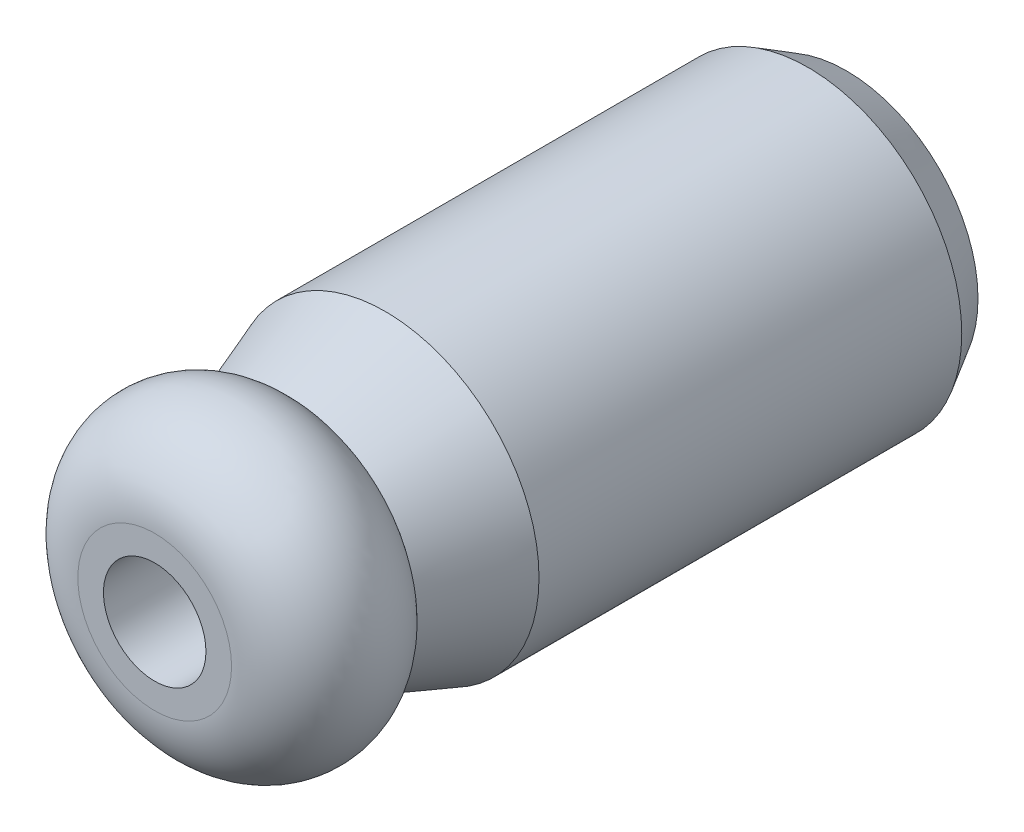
ISO-10303-21;
HEADER;
FILE_DESCRIPTION(('STEP AP214'),'2;1');
FILE_NAME('part.step','',(''),(''),'','','');
FILE_SCHEMA(('AUTOMOTIVE_DESIGN { 1 0 10303 214 1 1 1 1 }'));
ENDSEC;
DATA;
#1=APPLICATION_CONTEXT('core data for automotive mechanical design processes');
#2=APPLICATION_PROTOCOL_DEFINITION('international standard','automotive_design',2000,#1);
#3=PRODUCT_CONTEXT('',#1,'mechanical');
#4=PRODUCT('Part','Part','',(#3));
#5=PRODUCT_RELATED_PRODUCT_CATEGORY('part','',(#4));
#6=PRODUCT_DEFINITION_FORMATION('','',#4);
#7=PRODUCT_DEFINITION_CONTEXT('part definition',#1,'design');
#8=PRODUCT_DEFINITION('design','',#6,#7);
#9=PRODUCT_DEFINITION_SHAPE('','',#8);
#10=(LENGTH_UNIT() NAMED_UNIT(*) SI_UNIT(.MILLI.,.METRE.));
#11=(NAMED_UNIT(*) PLANE_ANGLE_UNIT() SI_UNIT($,.RADIAN.));
#12=(NAMED_UNIT(*) SI_UNIT($,.STERADIAN.) SOLID_ANGLE_UNIT());
#13=UNCERTAINTY_MEASURE_WITH_UNIT(LENGTH_MEASURE(1.E-05),#10,'distance_accuracy_value','');
#14=(GEOMETRIC_REPRESENTATION_CONTEXT(3) GLOBAL_UNCERTAINTY_ASSIGNED_CONTEXT((#13)) GLOBAL_UNIT_ASSIGNED_CONTEXT((#10,
#11,#12)) REPRESENTATION_CONTEXT('',''));
#15=CARTESIAN_POINT('',(0.,0.,0.));
#16=DIRECTION('',(0.,0.,1.));
#17=DIRECTION('',(1.,0.,0.));
#18=AXIS2_PLACEMENT_3D('',#15,#16,#17);
#19=CARTESIAN_POINT('',(0.,2.,19.));
#20=DIRECTION('',(0.,0.,1.));
#21=DIRECTION('',(1.,0.,0.));
#22=AXIS2_PLACEMENT_3D('',#19,#20,#21);
#23=PLANE('',#22);
#24=CARTESIAN_POINT('',(0.,0.,19.));
#25=DIRECTION('',(0.,0.,1.));
#26=DIRECTION('',(1.,0.,0.));
#27=AXIS2_PLACEMENT_3D('',#24,#25,#26);
#28=CIRCLE('',#27,2.);
#29=CARTESIAN_POINT('',(2.,0.,19.));
#30=VERTEX_POINT('',#29);
#31=EDGE_CURVE('E8',#30,#30,#28,.T.);
#32=ORIENTED_EDGE('',*,*,#31,.T.);
#33=EDGE_LOOP('',(#32));
#34=FACE_BOUND('',#33,.T.);
#35=ADVANCED_FACE('F12',(#34),#23,.T.);
#36=CARTESIAN_POINT('',(0.,0.,31.0699615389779));
#37=DIRECTION('',(0.,0.,1.));
#38=DIRECTION('',(1.,0.,0.));
#39=AXIS2_PLACEMENT_3D('',#36,#37,#38);
#40=CYLINDRICAL_SURFACE('',#39,2.);
#41=CARTESIAN_POINT('',(0.,0.,27.));
#42=DIRECTION('',(0.,0.,1.));
#43=DIRECTION('',(1.,0.,0.));
#44=AXIS2_PLACEMENT_3D('',#41,#42,#43);
#45=CIRCLE('',#44,2.);
#46=CARTESIAN_POINT('',(2.,0.,27.));
#47=VERTEX_POINT('',#46);
#48=EDGE_CURVE('E18',#47,#47,#45,.T.);
#49=ORIENTED_EDGE('',*,*,#48,.T.);
#50=EDGE_LOOP('',(#49));
#51=FACE_BOUND('',#50,.T.);
#52=ORIENTED_EDGE('',*,*,#31,.F.);
#53=EDGE_LOOP('',(#52));
#54=FACE_BOUND('',#53,.T.);
#55=ADVANCED_FACE('F54',(#51,#54),#40,.F.);
#56=CARTESIAN_POINT('',(0.,3.,27.));
#57=DIRECTION('',(0.,0.,1.));
#58=DIRECTION('',(1.,0.,0.));
#59=AXIS2_PLACEMENT_3D('',#56,#57,#58);
#60=PLANE('',#59);
#61=CARTESIAN_POINT('',(0.,0.,27.));
#62=DIRECTION('',(0.,0.,1.));
#63=DIRECTION('',(1.,0.,0.));
#64=AXIS2_PLACEMENT_3D('',#61,#62,#63);
#65=CIRCLE('',#64,3.);
#66=CARTESIAN_POINT('',(3.,0.,27.));
#67=VERTEX_POINT('',#66);
#68=EDGE_CURVE('E22',#67,#67,#65,.T.);
#69=ORIENTED_EDGE('',*,*,#68,.T.);
#70=EDGE_LOOP('',(#69));
#71=FACE_BOUND('',#70,.T.);
#72=ORIENTED_EDGE('',*,*,#48,.F.);
#73=EDGE_LOOP('',(#72));
#74=FACE_BOUND('',#73,.T.);
#75=ADVANCED_FACE('F58',(#71,#74),#60,.T.);
#76=CARTESIAN_POINT('',(0.,0.,23.9999999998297));
#77=DIRECTION('',(0.,0.,1.));
#78=DIRECTION('',(1.,0.,0.));
#79=AXIS2_PLACEMENT_3D('',#76,#77,#78);
#80=DEGENERATE_TOROIDAL_SURFACE('',#79,2.9999999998,3.00000000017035,.T.);
#81=CARTESIAN_POINT('',(0.,0.,21.53691825));
#82=DIRECTION('',(0.,0.,1.));
#83=DIRECTION('',(1.,0.,0.));
#84=AXIS2_PLACEMENT_3D('',#81,#82,#83);
#85=CIRCLE('',#84,4.712667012);
#86=CARTESIAN_POINT('',(4.712667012,0.,21.53691825));
#87=VERTEX_POINT('',#86);
#88=EDGE_CURVE('E26',#87,#87,#85,.T.);
#89=ORIENTED_EDGE('',*,*,#88,.T.);
#90=EDGE_LOOP('',(#89));
#91=FACE_BOUND('',#90,.T.);
#92=ORIENTED_EDGE('',*,*,#68,.F.);
#93=EDGE_LOOP('',(#92));
#94=FACE_BOUND('',#93,.T.);
#95=ADVANCED_FACE('F62',(#91,#94),#80,.T.);
#96=CARTESIAN_POINT('',(0.,0.,21.53691825));
#97=DIRECTION('',(0.,0.,-1.));
#98=DIRECTION('',(-1.,0.,0.));
#99=AXIS2_PLACEMENT_3D('',#96,#97,#98);
#100=CONICAL_SURFACE('',#99,4.712667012,0.349065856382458);
#101=CARTESIAN_POINT('',(0.,0.,18.));
#102=DIRECTION('',(0.,0.,1.));
#103=DIRECTION('',(1.,0.,0.));
#104=AXIS2_PLACEMENT_3D('',#101,#102,#103);
#105=CIRCLE('',#104,6.);
#106=CARTESIAN_POINT('',(6.,0.,18.));
#107=VERTEX_POINT('',#106);
#108=EDGE_CURVE('E31',#107,#107,#105,.T.);
#109=ORIENTED_EDGE('',*,*,#108,.T.);
#110=EDGE_LOOP('',(#109));
#111=FACE_BOUND('',#110,.T.);
#112=ORIENTED_EDGE('',*,*,#88,.F.);
#113=EDGE_LOOP('',(#112));
#114=FACE_BOUND('',#113,.T.);
#115=ADVANCED_FACE('F69',(#111,#114),#100,.T.);
#116=CARTESIAN_POINT('',(0.,0.,31.0699615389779));
#117=DIRECTION('',(0.,0.,1.));
#118=DIRECTION('',(1.,0.,0.));
#119=AXIS2_PLACEMENT_3D('',#116,#117,#118);
#120=CYLINDRICAL_SURFACE('',#119,6.);
#121=CARTESIAN_POINT('',(0.,0.,1.5));
#122=DIRECTION('',(0.,0.,1.));
#123=DIRECTION('',(1.,0.,0.));
#124=AXIS2_PLACEMENT_3D('',#121,#122,#123);
#125=CIRCLE('',#124,6.);
#126=CARTESIAN_POINT('',(6.,0.,1.5));
#127=VERTEX_POINT('',#126);
#128=EDGE_CURVE('E34',#127,#127,#125,.T.);
#129=ORIENTED_EDGE('',*,*,#128,.T.);
#130=EDGE_LOOP('',(#129));
#131=FACE_BOUND('',#130,.T.);
#132=ORIENTED_EDGE('',*,*,#108,.F.);
#133=EDGE_LOOP('',(#132));
#134=FACE_BOUND('',#133,.T.);
#135=ADVANCED_FACE('F51',(#131,#134),#120,.T.);
#136=CARTESIAN_POINT('',(0.,0.,1.5));
#137=DIRECTION('',(0.,0.,1.));
#138=DIRECTION('',(1.,0.,0.));
#139=AXIS2_PLACEMENT_3D('',#136,#137,#138);
#140=CONICAL_SURFACE('',#139,6.,0.523598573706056);
#141=CARTESIAN_POINT('',(0.,0.,0.));
#142=DIRECTION('',(0.,0.,1.));
#143=DIRECTION('',(1.,0.,0.));
#144=AXIS2_PLACEMENT_3D('',#141,#142,#143);
#145=CIRCLE('',#144,5.133975);
#146=CARTESIAN_POINT('',(5.133975,0.,0.));
#147=VERTEX_POINT('',#146);
#148=EDGE_CURVE('E37',#147,#147,#145,.T.);
#149=ORIENTED_EDGE('',*,*,#148,.T.);
#150=EDGE_LOOP('',(#149));
#151=FACE_BOUND('',#150,.T.);
#152=ORIENTED_EDGE('',*,*,#128,.F.);
#153=EDGE_LOOP('',(#152));
#154=FACE_BOUND('',#153,.T.);
#155=ADVANCED_FACE('F41',(#151,#154),#140,.T.);
#156=CARTESIAN_POINT('',(0.,0.,0.));
#157=DIRECTION('',(0.,0.,-1.));
#158=DIRECTION('',(-1.,0.,0.));
#159=AXIS2_PLACEMENT_3D('',#156,#157,#158);
#160=PLANE('',#159);
#161=ORIENTED_EDGE('',*,*,#148,.F.);
#162=EDGE_LOOP('',(#161));
#163=FACE_BOUND('',#162,.T.);
#164=ADVANCED_FACE('F44',(#163),#160,.T.);
#165=CLOSED_SHELL('',(#35,#55,#75,#95,#115,#135,#155,#164));
#166=MANIFOLD_SOLID_BREP('B1',#165);
#167=ADVANCED_BREP_SHAPE_REPRESENTATION('',(#18,#166),#14);
#168=SHAPE_DEFINITION_REPRESENTATION(#9,#167);
ENDSEC;
END-ISO-10303-21;
